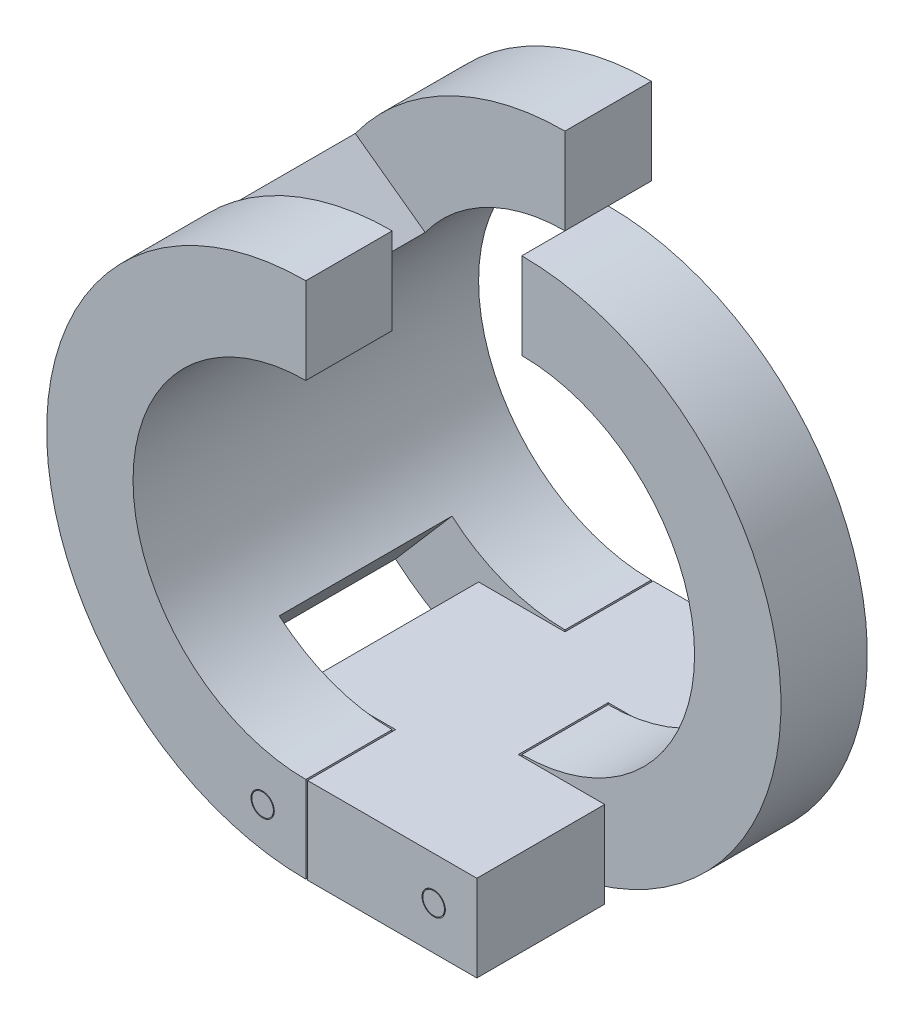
from build123d import *

# Parameters (mm, degrees)
BOSS_EXTRUDE1_DEPTH      = 6.35
BOSS_EXTRUDE2_DEPTH      = 6.35
BOSS_EXTRUDE3_DEPTH      = 3.175
BOSS_EXTRUDE3_DEPTH_BACK = 3.175
BOSS_EXTRUDE4_DEPTH      = 12.7
BOSS_EXTRUDE5_DEPTH      = 6.35
CUT_EXTRUDE1_DEPTH       = 41.659838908
CUT_EXTRUDE1_DEPTH_BACK  = 41.659838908
SKETCH7_R                = 0.85725
SKETCH8_R                = 0.79375
BOSS_EXTRUDE6_DEPTH      = 25.4
BOSS_EXTRUDE6_2_DEPTH    = 25.4


with BuildPart() as part:
    # Sketch1 → Boss-Extrude1 (new body)
    with BuildSketch(Plane.XY):
        with BuildLine():
            Line((0, 19.05), (0, 12.7))
            ThreePointArc((0, 12.7), (-12.7, 0), (0, -12.7))
            Line((0, -12.7), (0, -19.05))
            ThreePointArc((0, -19.05), (-19.05, 0), (0, 19.05))
        make_face()
    extrude(amount=BOSS_EXTRUDE1_DEPTH)



with BuildPart() as body_2:
    # Sketch3 → Boss-Extrude2 (new body)
    with BuildSketch(Plane.XY.offset(19.05)):
        with BuildLine():
            Line((0, -19.05), (0, -12.7))
            ThreePointArc((0, -12.7), (-12.7, 0), (0, 12.7))
            Line((0, 12.7), (0, 19.05))
            ThreePointArc((0, 19.05), (-19.05, 0), (0, -19.05))
        make_face()
    extrude(amount=BOSS_EXTRUDE2_DEPTH)


with BuildPart() as body_3:
    # Sketch4 → Boss-Extrude3 (new, two sides: drawn at the far end of the back side and taken through both)
    with BuildSketch(Plane.XY.offset(12.7).offset(-BOSS_EXTRUDE3_DEPTH_BACK)):
        with BuildLine():
            Line((6.35, 19.05), (6.35, 12.7))
            ThreePointArc((6.35, 12.7), (19.05, 0), (6.35, -12.7))
            Line((6.35, -12.7), (6.35, -19.05))
            ThreePointArc((6.35, -19.05), (25.4, 0), (6.35, 19.05))
        make_face()
    extrude(amount=BOSS_EXTRUDE3_DEPTH + BOSS_EXTRUDE3_DEPTH_BACK)


with BuildPart() as part_1:
    add(part.part)

    add(body_2.part)  # Boss-Extrude4 merges body 2
    # Sketch5 → Boss-Extrude4 (add)
    with BuildSketch(Plane.XY.offset(6.35)):
        with BuildLine():
            Line((-10.276753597, 7.461791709), (-15.415130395, 11.192687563))
            ThreePointArc((-15.415130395, 11.192687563), (-18.92396617, -2.187693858), (-12.454817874, -14.414576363))
            Line((-12.454817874, -14.414576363), (-8.303211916, -9.609717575))
            ThreePointArc((-8.303211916, -9.609717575), (-12.615977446, -1.458462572), (-10.276753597, 7.461791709))
        make_face()
    extrude(amount=BOSS_EXTRUDE4_DEPTH)


with BuildPart() as body_3_2:
    # Sketch6 → Boss-Extrude5 (new body)
    with BuildSketch(Plane(origin=(0, -19.05, 0), x_dir=(0, 0, -1), z_dir=(0, 1, 0))):
        Polygon((-25.4, -12.573), (-25.4, -0.127), (-18.923, -0.127), (-18.923, 6.223), (-6.477, 6.223), (-6.477, -0.127), (0, -0.127), (0, -12.573), (-9.398, -12.573), (-9.398, -6.223), (-16.002, -6.223), (-16.002, -12.573), align=None)
    extrude(amount=BOSS_EXTRUDE5_DEPTH)


with BuildPart() as cut_extrude1_tool:
    # Sketch7 → Cut-Extrude1 (new, two sides: drawn at the far end of the back side and taken through both)
    with BuildSketch(Plane.XY.offset(25.4).offset(-CUT_EXTRUDE1_DEPTH_BACK)):
        with Locations((9.398, -15.875)):
            Circle(SKETCH7_R)
        with Locations((-3.175, -15.875)):
            Circle(SKETCH7_R)
    extrude(amount=CUT_EXTRUDE1_DEPTH + CUT_EXTRUDE1_DEPTH_BACK)


with BuildPart() as part_2:
    add(part_1.part)

    # Cut-Extrude1: cut by cut_extrude1_tool
    add(cut_extrude1_tool.part, mode=Mode.SUBTRACT)


with BuildPart() as body_3_1:
    add(body_3.part)

    # Cut-Extrude1: cut by cut_extrude1_tool
    add(cut_extrude1_tool.part, mode=Mode.SUBTRACT)


with BuildPart() as body_3_2_1:
    add(body_3_2.part)

    # Cut-Extrude1: cut by cut_extrude1_tool
    add(cut_extrude1_tool.part, mode=Mode.SUBTRACT)


with BuildPart() as body_4:
    # Sketch8 → Boss-Extrude6 (new, through all)
    with BuildSketch(Plane.XY.offset(25.4)):
        with Locations((-3.175, -15.875)):
            Circle(SKETCH8_R)
    extrude(amount=-BOSS_EXTRUDE6_DEPTH)


with BuildPart() as body_5:
    # Sketch8 → Boss-Extrude6 2 (new, through all)
    with BuildSketch(Plane.XY.offset(25.4)):
        with Locations((9.398, -15.875)):
            Circle(SKETCH8_R)
    extrude(amount=-BOSS_EXTRUDE6_2_DEPTH)


solid = Compound([part_2.part, body_3_1.part, body_3_2_1.part, body_4.part, body_5.part])
